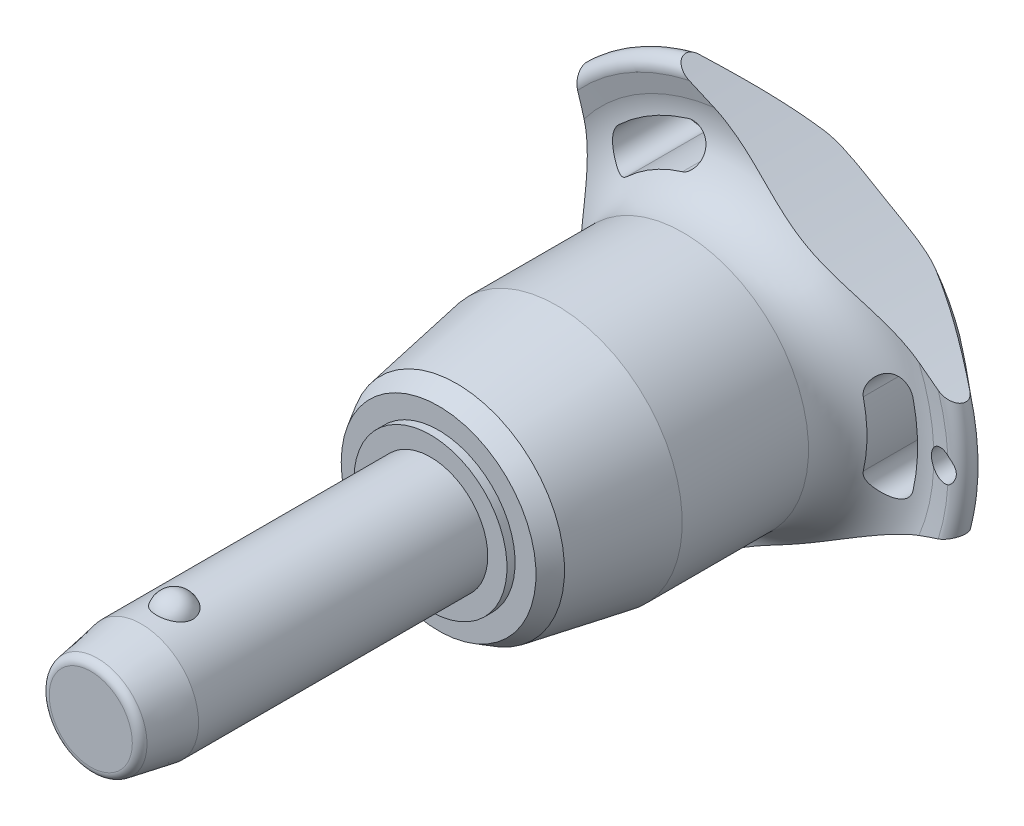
from build123d import *

# Parameters (mm, degrees)
SKETCH1_R           = 6
BOSS_EXTRUDE1_DEPTH = 25
SKETCH2_R           = 5.15
BOSS_EXTRUDE2_DEPTH = 39.7
BOSS_EXTRUDE3_START = 10.6
SKETCH1_2_R         = 6
BOSS_EXTRUDE3_DEPTH = 10.6
CHAMFER1_SIZE       = 5.3
CHAMFER1_SIZE2      = 0.934532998
FILLET1_R           = 0.85
SKETCH6_R           = 144.275
CUT_EXTRUDE1_DEPTH  = 73.933914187
CIRPATTERN1_COUNT   = 3
SKETCH7_R           = 1.5
CUT_EXTRUDE2_DEPTH  = 73.658226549


with BuildPart() as part:
    # Sketch1 → Boss-Extrude1 (new body)
    with BuildSketch(Plane.XY):
        Circle(SKETCH1_R)
    extrude(amount=-BOSS_EXTRUDE1_DEPTH)

    # Sketch2 → Boss-Extrude2 (add)
    with BuildSketch(Plane(origin=(0, 0, -25), x_dir=(-1, 0, 0), z_dir=(0, 0, -1))):
        Circle(SKETCH2_R)
    extrude(amount=BOSS_EXTRUDE2_DEPTH)

    # Sketch3 → Revolve1 (revolve)
    with BuildSketch(Plane(origin=(0, 0, 0), x_dir=(0, 0, -1), z_dir=(1, 0, 0))):
        with BuildLine():
            Line((-1.854049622, 7.25), (-1.854049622, 3.25))
            ThreePointArc((-1.854049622, 3.25), (0.145950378, 5.25), (-1.854049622, 7.25))
        make_face()
        with BuildLine():
            Line((-1.854049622, -3.25), (-1.854049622, -7.25))
            ThreePointArc((-1.854049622, -7.25), (0.145950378, -5.25), (-1.854049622, -3.25))
        make_face()
    revolve(axis=Axis((0, -3.25, 1.854049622), (0, 1, 0)))

    # Sketch1_2 → Boss-Extrude3 (add)
    with BuildSketch(Plane.XY.offset(BOSS_EXTRUDE3_START)):
        Circle(SKETCH1_2_R)
    extrude(amount=-BOSS_EXTRUDE3_DEPTH)

    # Chamfer1
    chamfer1_edges = [part.edges().sort_by_distance(p)[0] for p in [
        (-6, 0, 10.6),
    ]]
    chamfer1_side = [part.faces().sort_by_distance(p)[0] for p in [
        (-6, 0, -7.2),
    ]]
    chamfer(chamfer1_edges, length=CHAMFER1_SIZE, length2=CHAMFER1_SIZE2, reference=chamfer1_side[0])

    # Fillet1
    fillet1_edges = [part.edges().sort_by_distance(p)[0] for p in [
        (-5.065467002, 0, 10.6),
        (5.15, 0, -64.7),
    ]]
    fillet(fillet1_edges, radius=FILLET1_R)

    # Sketch4 → Revolve2 (revolve)
    with BuildSketch(Plane(origin=(0, 0, 0), x_dir=(0, 0, -1), z_dir=(1, 0, 0)), mode=Mode.PRIVATE) as revolve2_sk:
        Polygon((25, 0), (25, 8.017240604), (25.85, 8.017240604), (25.85, 10.206249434), (27.745737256, 11.300753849), (38.233333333, 13.15), (51.466666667, 13.15), (51.466666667, 0), align=None)
    revolve(revolve2_sk.sketch.rotate(Axis((0, 0, -51.466666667), (0, 0, 1)), 90), axis=Axis((0, 0, -51.466666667), (0, 0, 1)))

    # Sketch5 → Revolve3 (revolve)
    with BuildSketch(Plane(origin=(0, 0, 0), x_dir=(0, 0, -1), z_dir=(1, 0, 0)), mode=Mode.PRIVATE) as revolve3_sk:
        with BuildLine():
            Line((57.32877039, 20.428960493), (56.910912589, 22.344207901))
            ThreePointArc((56.910912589, 22.344207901), (57.554394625, 23.677136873), (59.002586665, 23.371345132))
            Line((59.002586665, 23.371345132), (64.141488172, 17.247040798))
            ThreePointArc((64.141488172, 17.247040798), (64.7, 15.584758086), (63.978803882, 13.986322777))
            ThreePointArc((63.978803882, 13.986322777), (59.617427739, 7.589034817), (58.083333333, 0))
            Line((58.083333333, 0), (51.466666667, 0))
            Line((51.466666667, 0), (51.466666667, 13.15))
            ThreePointArc((51.466666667, 13.15), (56.139661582, 15.38660811), (57.32877039, 20.428960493))
        make_face()
    revolve(revolve3_sk.sketch.rotate(Axis((0, 0, -58.083333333), (0, 0, 1)), 90), axis=Axis((0, 0, -58.083333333), (0, 0, 1)))

    # Sketch6 → Cut-Extrude1 (cut, through all)
    with BuildSketch(Plane.XY):
        with Locations((-159.975, 0)):
            Circle(SKETCH6_R)
        with BuildLine():
            ThreePointArc((18.131206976, -4.190753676), (18.60922037, 0), (18.131206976, 4.190753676))
            ThreePointArc((18.131206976, 4.190753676), (15.94840906, 5.553949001), (14.585213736, 3.371151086))
            ThreePointArc((14.585213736, 3.371151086), (14.969740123, 0), (14.585213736, -3.371151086))
            ThreePointArc((14.585213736, -3.371151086), (15.94840906, -5.553949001), (18.131206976, -4.190753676))
        make_face()
    cut_extrude1 = extrude(amount=-CUT_EXTRUDE1_DEPTH, mode=Mode.SUBTRACT)

    # CirPattern1: Cut-Extrude1 ×3 about axis
    cirpattern1_axis = Axis((0, 0, 0), (0, 0, 1))
    for i in range(1, CIRPATTERN1_COUNT):
        add(cut_extrude1.rotate(cirpattern1_axis, i * 360 / CIRPATTERN1_COUNT), mode=Mode.SUBTRACT)

    # Sketch7 → Cut-Extrude2 (cut, through all)
    with BuildSketch(Plane.XY):
        with Locations(Location((21.60922037, 0, 0), (0, 0, 297.620773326))):
            Circle(SKETCH7_R)
    extrude(amount=-CUT_EXTRUDE2_DEPTH, mode=Mode.SUBTRACT)


solid = part.part
